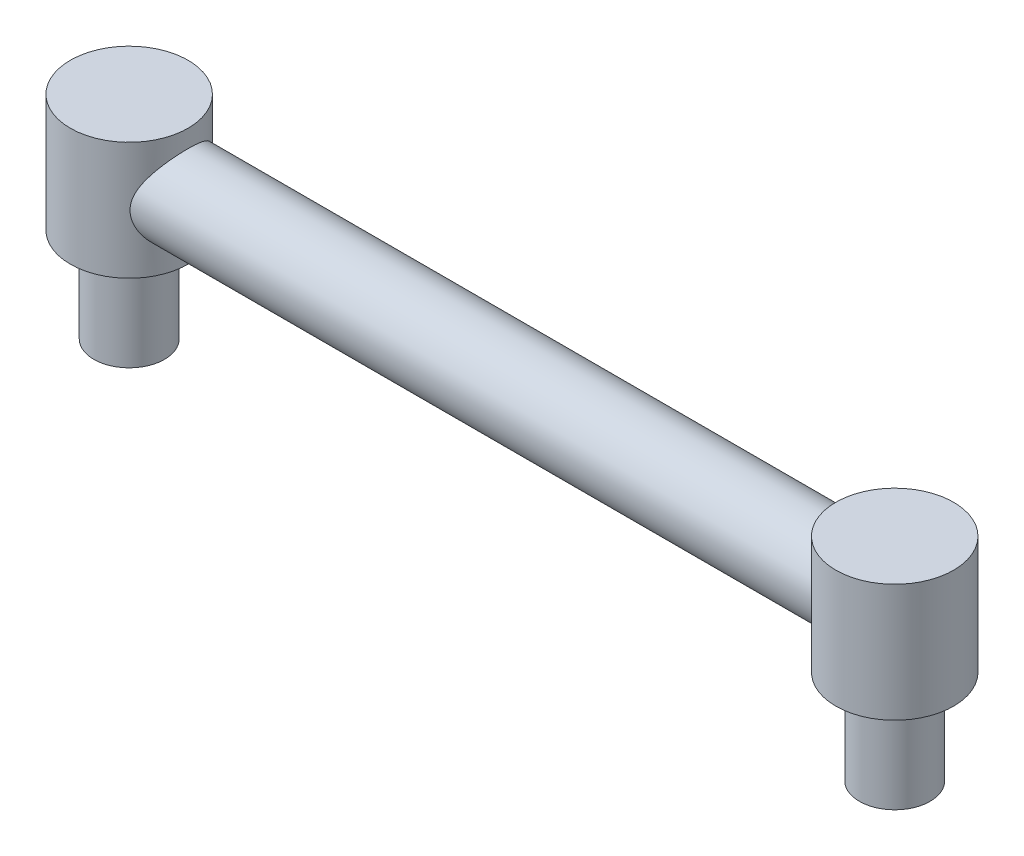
from build123d import *

# Parameters (mm, degrees)
CROQUIS3_R              = 3.5
SALIENTE_EXTRUIR1_DEPTH = 65
CROQUIS4_R              = 5
SALIENTE_EXTRUIR2_DEPTH = 5
CROQUIS5_R              = 3
SALIENTE_EXTRUIR3_DEPTH = 8


with BuildPart() as part:
    # Croquis3 → Saliente-Extruir1 (new body)
    with BuildSketch(Plane(origin=(0, 0, 0), x_dir=(0, 0, -1), z_dir=(1, 0, 0))):
        Circle(CROQUIS3_R)
    extrude(amount=SALIENTE_EXTRUIR1_DEPTH)

    # Croquis4 → Saliente-Extruir2 (add, symmetric)
    with BuildSketch(Plane(origin=(0, 0, 0), x_dir=(1, 0, 0), z_dir=(0, 1, 0))):
        with Locations(Location((65, 0, 0), (0, 0, 270))):
            Circle(CROQUIS4_R)
        with Locations(Location((0, 0, 0), (0, 0, 270))):
            Circle(CROQUIS4_R)
    extrude(amount=SALIENTE_EXTRUIR2_DEPTH, both=True)

    # Croquis5 → Saliente-Extruir3 (add)
    with BuildSketch(Plane.XZ.offset(5)):
        with Locations(Location((65, 0, 0), (0, 0, 270))):
            Circle(CROQUIS5_R)
        with Locations(Location((0, 0, 0), (0, 0, 270))):
            Circle(CROQUIS5_R)
    extrude(amount=SALIENTE_EXTRUIR3_DEPTH)


solid = part.part
